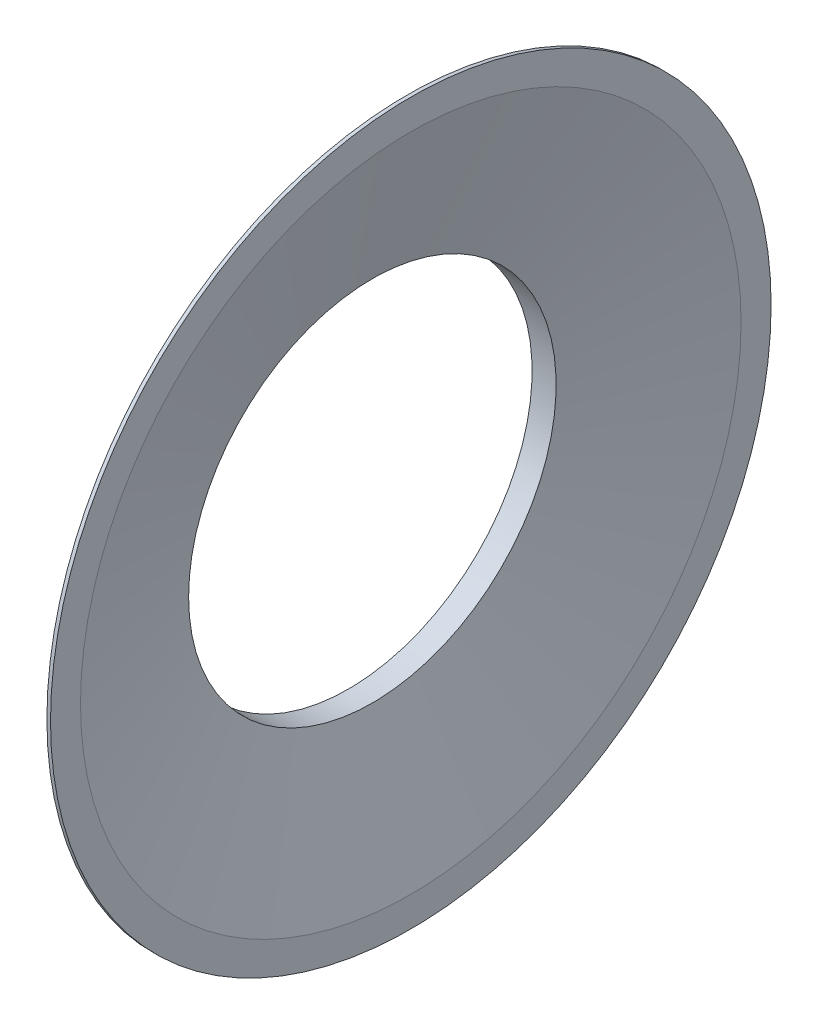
ISO-10303-21;
HEADER;
FILE_DESCRIPTION(('STEP AP214'),'2;1');
FILE_NAME('part.step','',(''),(''),'','','');
FILE_SCHEMA(('AUTOMOTIVE_DESIGN { 1 0 10303 214 1 1 1 1 }'));
ENDSEC;
DATA;
#1=APPLICATION_CONTEXT('core data for automotive mechanical design processes');
#2=APPLICATION_PROTOCOL_DEFINITION('international standard','automotive_design',2000,#1);
#3=PRODUCT_CONTEXT('',#1,'mechanical');
#4=PRODUCT('Part','Part','',(#3));
#5=PRODUCT_RELATED_PRODUCT_CATEGORY('part','',(#4));
#6=PRODUCT_DEFINITION_FORMATION('','',#4);
#7=PRODUCT_DEFINITION_CONTEXT('part definition',#1,'design');
#8=PRODUCT_DEFINITION('design','',#6,#7);
#9=PRODUCT_DEFINITION_SHAPE('','',#8);
#10=(LENGTH_UNIT() NAMED_UNIT(*) SI_UNIT(.MILLI.,.METRE.));
#11=(NAMED_UNIT(*) PLANE_ANGLE_UNIT() SI_UNIT($,.RADIAN.));
#12=(NAMED_UNIT(*) SI_UNIT($,.STERADIAN.) SOLID_ANGLE_UNIT());
#13=UNCERTAINTY_MEASURE_WITH_UNIT(LENGTH_MEASURE(1.E-05),#10,'distance_accuracy_value','');
#14=(GEOMETRIC_REPRESENTATION_CONTEXT(3) GLOBAL_UNCERTAINTY_ASSIGNED_CONTEXT((#13)) GLOBAL_UNIT_ASSIGNED_CONTEXT((#10,
#11,#12)) REPRESENTATION_CONTEXT('',''));
#15=CARTESIAN_POINT('',(0.,0.,0.));
#16=DIRECTION('',(0.,0.,1.));
#17=DIRECTION('',(1.,0.,0.));
#18=AXIS2_PLACEMENT_3D('',#15,#16,#17);
#19=CARTESIAN_POINT('',(0.,0.,0.));
#20=DIRECTION('',(-1.,0.,0.));
#21=DIRECTION('',(0.,0.,1.));
#22=AXIS2_PLACEMENT_3D('',#19,#20,#21);
#23=CYLINDRICAL_SURFACE('',#22,31.2);
#24=CARTESIAN_POINT('',(0.,0.,0.));
#25=DIRECTION('',(-1.,0.,0.));
#26=DIRECTION('',(0.,0.,1.));
#27=AXIS2_PLACEMENT_3D('',#24,#25,#26);
#28=CIRCLE('',#27,31.2);
#29=CARTESIAN_POINT('',(0.,0.,31.2));
#30=VERTEX_POINT('',#29);
#31=EDGE_CURVE('E10',#30,#30,#28,.T.);
#32=ORIENTED_EDGE('',*,*,#31,.F.);
#33=EDGE_LOOP('',(#32));
#34=FACE_BOUND('',#33,.T.);
#35=CARTESIAN_POINT('',(3.4,0.,0.));
#36=DIRECTION('',(-1.,0.,0.));
#37=DIRECTION('',(0.,0.,1.));
#38=AXIS2_PLACEMENT_3D('',#35,#36,#37);
#39=CIRCLE('',#38,31.2);
#40=CARTESIAN_POINT('',(3.4,0.,31.2));
#41=VERTEX_POINT('',#40);
#42=EDGE_CURVE('E57',#41,#41,#39,.T.);
#43=ORIENTED_EDGE('',*,*,#42,.T.);
#44=EDGE_LOOP('',(#43));
#45=FACE_BOUND('',#44,.T.);
#46=ADVANCED_FACE('F29',(#34,#45),#23,.T.);
#47=CARTESIAN_POINT('',(0.,30.6,0.));
#48=DIRECTION('',(1.,0.,0.));
#49=DIRECTION('',(0.,0.,-1.));
#50=AXIS2_PLACEMENT_3D('',#47,#48,#49);
#51=PLANE('',#50);
#52=CARTESIAN_POINT('',(0.,0.,0.));
#53=DIRECTION('',(-1.,0.,0.));
#54=DIRECTION('',(0.,0.,1.));
#55=AXIS2_PLACEMENT_3D('',#52,#53,#54);
#56=CIRCLE('',#55,30.6);
#57=CARTESIAN_POINT('',(0.,0.,30.6));
#58=VERTEX_POINT('',#57);
#59=EDGE_CURVE('E35',#58,#58,#56,.T.);
#60=ORIENTED_EDGE('',*,*,#59,.F.);
#61=EDGE_LOOP('',(#60));
#62=FACE_BOUND('',#61,.T.);
#63=ORIENTED_EDGE('',*,*,#31,.T.);
#64=EDGE_LOOP('',(#63));
#65=FACE_BOUND('',#64,.T.);
#66=ADVANCED_FACE('F94',(#62,#65),#51,.F.);
#67=CARTESIAN_POINT('',(0.,0.,0.));
#68=DIRECTION('',(-1.,0.,0.));
#69=DIRECTION('',(0.,0.,1.));
#70=AXIS2_PLACEMENT_3D('',#67,#68,#69);
#71=CYLINDRICAL_SURFACE('',#70,30.6);
#72=CARTESIAN_POINT('',(4.,0.,0.));
#73=DIRECTION('',(-1.,0.,0.));
#74=DIRECTION('',(0.,0.,1.));
#75=AXIS2_PLACEMENT_3D('',#72,#73,#74);
#76=CIRCLE('',#75,30.6);
#77=CARTESIAN_POINT('',(4.,0.,30.6));
#78=VERTEX_POINT('',#77);
#79=EDGE_CURVE('E39',#78,#78,#76,.T.);
#80=ORIENTED_EDGE('',*,*,#79,.F.);
#81=EDGE_LOOP('',(#80));
#82=FACE_BOUND('',#81,.T.);
#83=ORIENTED_EDGE('',*,*,#59,.T.);
#84=EDGE_LOOP('',(#83));
#85=FACE_BOUND('',#84,.T.);
#86=ADVANCED_FACE('F89',(#82,#85),#71,.F.);
#87=CARTESIAN_POINT('',(4.,0.,0.));
#88=DIRECTION('',(1.,0.,0.));
#89=DIRECTION('',(0.,0.,-1.));
#90=AXIS2_PLACEMENT_3D('',#87,#88,#89);
#91=CONICAL_SURFACE('',#90,30.6,1.31427971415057);
#92=CARTESIAN_POINT('',(10.4,0.,0.));
#93=DIRECTION('',(-1.,0.,0.));
#94=DIRECTION('',(0.,0.,1.));
#95=AXIS2_PLACEMENT_3D('',#92,#93,#94);
#96=CIRCLE('',#95,55.);
#97=CARTESIAN_POINT('',(10.4,0.,55.));
#98=VERTEX_POINT('',#97);
#99=EDGE_CURVE('E43',#98,#98,#96,.T.);
#100=ORIENTED_EDGE('',*,*,#99,.F.);
#101=EDGE_LOOP('',(#100));
#102=FACE_BOUND('',#101,.T.);
#103=ORIENTED_EDGE('',*,*,#79,.T.);
#104=EDGE_LOOP('',(#103));
#105=FACE_BOUND('',#104,.T.);
#106=ADVANCED_FACE('F83',(#102,#105),#91,.F.);
#107=CARTESIAN_POINT('',(10.4,55.,0.));
#108=DIRECTION('',(-1.,0.,0.));
#109=DIRECTION('',(0.,0.,1.));
#110=AXIS2_PLACEMENT_3D('',#107,#108,#109);
#111=PLANE('',#110);
#112=CARTESIAN_POINT('',(10.4,0.,0.));
#113=DIRECTION('',(-1.,0.,0.));
#114=DIRECTION('',(0.,0.,1.));
#115=AXIS2_PLACEMENT_3D('',#112,#113,#114);
#116=CIRCLE('',#115,60.);
#117=CARTESIAN_POINT('',(10.4,0.,60.));
#118=VERTEX_POINT('',#117);
#119=EDGE_CURVE('E48',#118,#118,#116,.T.);
#120=ORIENTED_EDGE('',*,*,#119,.F.);
#121=EDGE_LOOP('',(#120));
#122=FACE_BOUND('',#121,.T.);
#123=ORIENTED_EDGE('',*,*,#99,.T.);
#124=EDGE_LOOP('',(#123));
#125=FACE_BOUND('',#124,.T.);
#126=ADVANCED_FACE('F77',(#122,#125),#111,.F.);
#127=CARTESIAN_POINT('',(0.,0.,0.));
#128=DIRECTION('',(-1.,0.,0.));
#129=DIRECTION('',(0.,0.,1.));
#130=AXIS2_PLACEMENT_3D('',#127,#128,#129);
#131=CYLINDRICAL_SURFACE('',#130,60.);
#132=CARTESIAN_POINT('',(9.8,0.,0.));
#133=DIRECTION('',(-1.,0.,0.));
#134=DIRECTION('',(0.,0.,1.));
#135=AXIS2_PLACEMENT_3D('',#132,#133,#134);
#136=CIRCLE('',#135,60.);
#137=CARTESIAN_POINT('',(9.8,0.,60.));
#138=VERTEX_POINT('',#137);
#139=EDGE_CURVE('E51',#138,#138,#136,.T.);
#140=ORIENTED_EDGE('',*,*,#139,.F.);
#141=EDGE_LOOP('',(#140));
#142=FACE_BOUND('',#141,.T.);
#143=ORIENTED_EDGE('',*,*,#119,.T.);
#144=EDGE_LOOP('',(#143));
#145=FACE_BOUND('',#144,.T.);
#146=ADVANCED_FACE('F71',(#142,#145),#131,.T.);
#147=CARTESIAN_POINT('',(9.8,55.,0.));
#148=DIRECTION('',(1.,0.,0.));
#149=DIRECTION('',(0.,0.,-1.));
#150=AXIS2_PLACEMENT_3D('',#147,#148,#149);
#151=PLANE('',#150);
#152=CARTESIAN_POINT('',(9.8,0.,0.));
#153=DIRECTION('',(-1.,0.,0.));
#154=DIRECTION('',(0.,0.,1.));
#155=AXIS2_PLACEMENT_3D('',#152,#153,#154);
#156=CIRCLE('',#155,55.);
#157=CARTESIAN_POINT('',(9.8,0.,55.));
#158=VERTEX_POINT('',#157);
#159=EDGE_CURVE('E54',#158,#158,#156,.T.);
#160=ORIENTED_EDGE('',*,*,#159,.F.);
#161=EDGE_LOOP('',(#160));
#162=FACE_BOUND('',#161,.T.);
#163=ORIENTED_EDGE('',*,*,#139,.T.);
#164=EDGE_LOOP('',(#163));
#165=FACE_BOUND('',#164,.T.);
#166=ADVANCED_FACE('F65',(#162,#165),#151,.F.);
#167=CARTESIAN_POINT('',(9.8,0.,0.));
#168=DIRECTION('',(1.,0.,0.));
#169=DIRECTION('',(0.,0.,-1.));
#170=AXIS2_PLACEMENT_3D('',#167,#168,#169);
#171=CONICAL_SURFACE('',#170,55.,1.30810298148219);
#172=ORIENTED_EDGE('',*,*,#42,.F.);
#173=EDGE_LOOP('',(#172));
#174=FACE_BOUND('',#173,.T.);
#175=ORIENTED_EDGE('',*,*,#159,.T.);
#176=EDGE_LOOP('',(#175));
#177=FACE_BOUND('',#176,.T.);
#178=ADVANCED_FACE('F62',(#174,#177),#171,.T.);
#179=CLOSED_SHELL('',(#46,#66,#86,#106,#126,#146,#166,#178));
#180=MANIFOLD_SOLID_BREP('B2',#179);
#181=ADVANCED_BREP_SHAPE_REPRESENTATION('',(#18,#180),#14);
#182=SHAPE_DEFINITION_REPRESENTATION(#9,#181);
ENDSEC;
END-ISO-10303-21;
